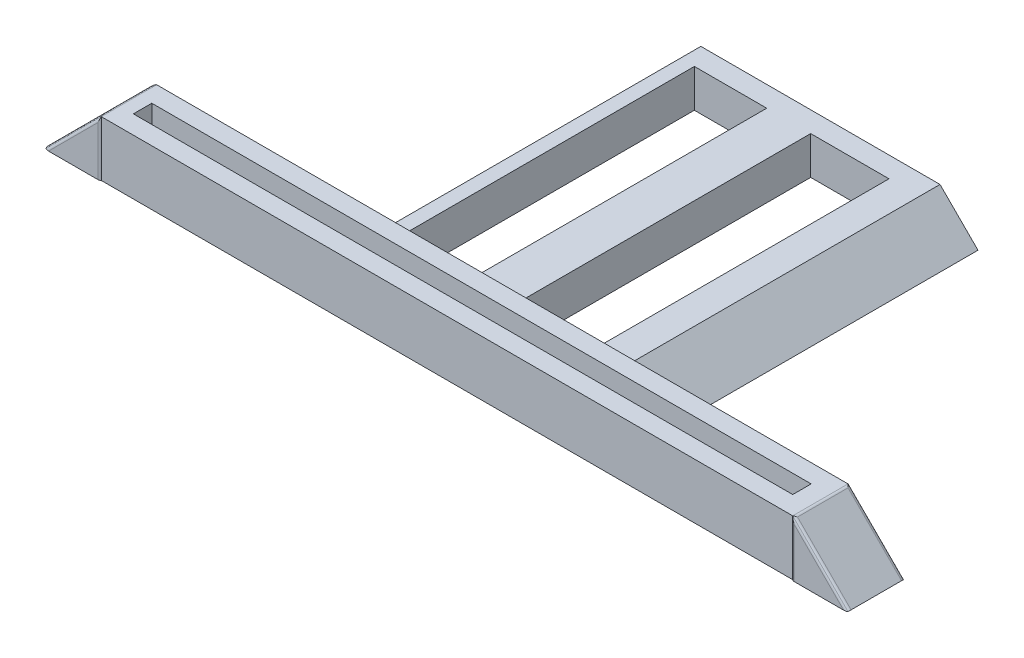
ISO-10303-21;
HEADER;
FILE_DESCRIPTION(('STEP AP214'),'2;1');
FILE_NAME('part.step','',(''),(''),'','','');
FILE_SCHEMA(('AUTOMOTIVE_DESIGN { 1 0 10303 214 1 1 1 1 }'));
ENDSEC;
DATA;
#1=APPLICATION_CONTEXT('core data for automotive mechanical design processes');
#2=APPLICATION_PROTOCOL_DEFINITION('international standard','automotive_design',2000,#1);
#3=PRODUCT_CONTEXT('',#1,'mechanical');
#4=PRODUCT('Part','Part','',(#3));
#5=PRODUCT_RELATED_PRODUCT_CATEGORY('part','',(#4));
#6=PRODUCT_DEFINITION_FORMATION('','',#4);
#7=PRODUCT_DEFINITION_CONTEXT('part definition',#1,'design');
#8=PRODUCT_DEFINITION('design','',#6,#7);
#9=PRODUCT_DEFINITION_SHAPE('','',#8);
#10=(LENGTH_UNIT() NAMED_UNIT(*) SI_UNIT(.MILLI.,.METRE.));
#11=(NAMED_UNIT(*) PLANE_ANGLE_UNIT() SI_UNIT($,.RADIAN.));
#12=(NAMED_UNIT(*) SI_UNIT($,.STERADIAN.) SOLID_ANGLE_UNIT());
#13=UNCERTAINTY_MEASURE_WITH_UNIT(LENGTH_MEASURE(1.E-05),#10,'distance_accuracy_value','');
#14=(GEOMETRIC_REPRESENTATION_CONTEXT(3) GLOBAL_UNCERTAINTY_ASSIGNED_CONTEXT((#13)) GLOBAL_UNIT_ASSIGNED_CONTEXT((#10,
#11,#12)) REPRESENTATION_CONTEXT('',''));
#15=CARTESIAN_POINT('',(0.,0.,0.));
#16=DIRECTION('',(0.,0.,1.));
#17=DIRECTION('',(1.,0.,0.));
#18=AXIS2_PLACEMENT_3D('',#15,#16,#17);
#19=CARTESIAN_POINT('',(-1905.,0.,-152.4));
#20=DIRECTION('',(0.,0.,-1.));
#21=DIRECTION('',(-1.,0.,0.));
#22=AXIS2_PLACEMENT_3D('',#19,#20,#21);
#23=PLANE('',#22);
#24=DIRECTION('',(1.,0.,0.));
#25=VECTOR('',#24,1.);
#26=CARTESIAN_POINT('',(-1905.,0.,-152.4));
#27=LINE('',#26,#25);
#28=CARTESIAN_POINT('',(-1905.,0.,-152.4));
#29=VERTEX_POINT('',#28);
#30=CARTESIAN_POINT('',(-1399.16371087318,0.,-152.4));
#31=VERTEX_POINT('',#30);
#32=EDGE_CURVE('E266',#29,#31,#27,.T.);
#33=ORIENTED_EDGE('',*,*,#32,.F.);
#34=DIRECTION('',(0.,-1.,0.));
#35=VECTOR('',#34,1.);
#36=CARTESIAN_POINT('',(-1905.,152.4,-152.4));
#37=LINE('',#36,#35);
#38=CARTESIAN_POINT('',(-1905.,152.4,-152.4));
#39=VERTEX_POINT('',#38);
#40=EDGE_CURVE('E261',#39,#29,#37,.T.);
#41=ORIENTED_EDGE('',*,*,#40,.F.);
#42=DIRECTION('',(1.,0.,0.));
#43=VECTOR('',#42,1.);
#44=CARTESIAN_POINT('',(-1905.,152.4,-152.4));
#45=LINE('',#44,#43);
#46=CARTESIAN_POINT('',(0.,152.4,-152.4));
#47=VERTEX_POINT('',#46);
#48=EDGE_CURVE('E263',#39,#47,#45,.T.);
#49=ORIENTED_EDGE('',*,*,#48,.T.);
#50=DIRECTION('',(0.,1.,0.));
#51=VECTOR('',#50,1.);
#52=CARTESIAN_POINT('',(0.,152.4,-152.4));
#53=LINE('',#52,#51);
#54=CARTESIAN_POINT('',(0.,0.,-152.4));
#55=VERTEX_POINT('',#54);
#56=EDGE_CURVE('E340',#55,#47,#53,.T.);
#57=ORIENTED_EDGE('',*,*,#56,.F.);
#58=CARTESIAN_POINT('',(-530.916609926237,0.,-152.4));
#59=VERTEX_POINT('',#58);
#60=EDGE_CURVE('E329',#59,#55,#27,.T.);
#61=ORIENTED_EDGE('',*,*,#60,.F.);
#62=DIRECTION('',(0.707106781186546,-0.707106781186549,0.));
#63=VECTOR('',#62,1.);
#64=CARTESIAN_POINT('',(-530.916609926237,0.,-152.4));
#65=LINE('',#64,#63);
#66=CARTESIAN_POINT('',(-635.558878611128,104.642268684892,-152.4));
#67=VERTEX_POINT('',#66);
#68=EDGE_CURVE('E477',#67,#59,#65,.T.);
#69=ORIENTED_EDGE('',*,*,#68,.F.);
#70=DIRECTION('',(1.,0.,0.));
#71=VECTOR('',#70,1.);
#72=CARTESIAN_POINT('',(-635.558878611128,104.642268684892,-152.4));
#73=LINE('',#72,#71);
#74=CARTESIAN_POINT('',(-1294.52144218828,104.642268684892,-152.4));
#75=VERTEX_POINT('',#74);
#76=EDGE_CURVE('E486',#75,#67,#73,.T.);
#77=ORIENTED_EDGE('',*,*,#76,.F.);
#78=DIRECTION('',(0.707106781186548,0.707106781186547,0.));
#79=VECTOR('',#78,1.);
#80=CARTESIAN_POINT('',(-1294.52144218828,104.642268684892,-152.4));
#81=LINE('',#80,#79);
#82=EDGE_CURVE('E472',#31,#75,#81,.T.);
#83=ORIENTED_EDGE('',*,*,#82,.F.);
#84=EDGE_LOOP('',(#33,#41,#49,#57,#61,#69,#77,#83));
#85=FACE_BOUND('',#84,.T.);
#86=ADVANCED_FACE('F35',(#85),#23,.T.);
#87=CARTESIAN_POINT('',(-1905.,0.,0.));
#88=DIRECTION('',(0.,0.,1.));
#89=DIRECTION('',(1.,0.,0.));
#90=AXIS2_PLACEMENT_3D('',#87,#88,#89);
#91=PLANE('',#90);
#92=DIRECTION('',(1.,0.,0.));
#93=VECTOR('',#92,1.);
#94=CARTESIAN_POINT('',(-1905.,152.4,0.));
#95=LINE('',#94,#93);
#96=CARTESIAN_POINT('',(-1905.,152.4,0.));
#97=VERTEX_POINT('',#96);
#98=CARTESIAN_POINT('',(0.,152.4,0.));
#99=VERTEX_POINT('',#98);
#100=EDGE_CURVE('E281',#97,#99,#95,.T.);
#101=ORIENTED_EDGE('',*,*,#100,.F.);
#102=DIRECTION('',(0.,1.,0.));
#103=VECTOR('',#102,1.);
#104=CARTESIAN_POINT('',(-1905.,152.4,0.));
#105=LINE('',#104,#103);
#106=CARTESIAN_POINT('',(-1905.,4.13763673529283E-13,0.));
#107=VERTEX_POINT('',#106);
#108=EDGE_CURVE('E317',#107,#97,#105,.T.);
#109=ORIENTED_EDGE('',*,*,#108,.F.);
#110=DIRECTION('',(1.,0.,0.));
#111=VECTOR('',#110,1.);
#112=CARTESIAN_POINT('',(-1905.,0.,0.));
#113=LINE('',#112,#111);
#114=CARTESIAN_POINT('',(0.,0.,0.));
#115=VERTEX_POINT('',#114);
#116=EDGE_CURVE('E294',#107,#115,#113,.T.);
#117=ORIENTED_EDGE('',*,*,#116,.T.);
#118=DIRECTION('',(0.,-1.,0.));
#119=VECTOR('',#118,1.);
#120=CARTESIAN_POINT('',(0.,152.4,0.));
#121=LINE('',#120,#119);
#122=EDGE_CURVE('E319',#99,#115,#121,.T.);
#123=ORIENTED_EDGE('',*,*,#122,.F.);
#124=EDGE_LOOP('',(#101,#109,#117,#123));
#125=FACE_BOUND('',#124,.T.);
#126=ADVANCED_FACE('F316',(#125),#91,.T.);
#127=CARTESIAN_POINT('',(-1905.,152.4,0.));
#128=DIRECTION('',(0.,1.,0.));
#129=DIRECTION('',(0.,0.,1.));
#130=AXIS2_PLACEMENT_3D('',#127,#128,#129);
#131=PLANE('',#130);
#132=DIRECTION('',(0.,0.,1.));
#133=VECTOR('',#132,1.);
#134=CARTESIAN_POINT('',(-1867.49816376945,152.4,-50.8));
#135=LINE('',#134,#133);
#136=CARTESIAN_POINT('',(-1867.49816376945,152.4,-101.6));
#137=VERTEX_POINT('',#136);
#138=CARTESIAN_POINT('',(-1867.49816376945,152.4,-50.8));
#139=VERTEX_POINT('',#138);
#140=EDGE_CURVE('E502',#137,#139,#135,.T.);
#141=ORIENTED_EDGE('',*,*,#140,.F.);
#142=DIRECTION('',(-1.,0.,0.));
#143=VECTOR('',#142,1.);
#144=CARTESIAN_POINT('',(-1867.49816376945,152.4,-101.6));
#145=LINE('',#144,#143);
#146=CARTESIAN_POINT('',(-50.8,152.4,-101.6));
#147=VERTEX_POINT('',#146);
#148=EDGE_CURVE('E507',#147,#137,#145,.T.);
#149=ORIENTED_EDGE('',*,*,#148,.F.);
#150=DIRECTION('',(0.,0.,-1.));
#151=VECTOR('',#150,1.);
#152=CARTESIAN_POINT('',(-50.8,152.4,-50.8));
#153=LINE('',#152,#151);
#154=CARTESIAN_POINT('',(-50.8,152.4,-50.8));
#155=VERTEX_POINT('',#154);
#156=EDGE_CURVE('E521',#155,#147,#153,.T.);
#157=ORIENTED_EDGE('',*,*,#156,.F.);
#158=DIRECTION('',(1.,0.,0.));
#159=VECTOR('',#158,1.);
#160=CARTESIAN_POINT('',(-1867.49816376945,152.4,-50.8));
#161=LINE('',#160,#159);
#162=EDGE_CURVE('E518',#139,#155,#161,.T.);
#163=ORIENTED_EDGE('',*,*,#162,.F.);
#164=EDGE_LOOP('',(#141,#149,#157,#163));
#165=FACE_BOUND('',#164,.T.);
#166=DIRECTION('',(0.,0.,1.));
#167=VECTOR('',#166,1.);
#168=CARTESIAN_POINT('',(0.,152.4,0.));
#169=LINE('',#168,#167);
#170=EDGE_CURVE('E279',#47,#99,#169,.T.);
#171=ORIENTED_EDGE('',*,*,#170,.F.);
#172=ORIENTED_EDGE('',*,*,#48,.F.);
#173=DIRECTION('',(0.,0.,1.));
#174=VECTOR('',#173,1.);
#175=CARTESIAN_POINT('',(-1905.,152.4,0.));
#176=LINE('',#175,#174);
#177=EDGE_CURVE('E276',#39,#97,#176,.T.);
#178=ORIENTED_EDGE('',*,*,#177,.T.);
#179=ORIENTED_EDGE('',*,*,#100,.T.);
#180=EDGE_LOOP('',(#171,#172,#178,#179));
#181=FACE_BOUND('',#180,.T.);
#182=ADVANCED_FACE('F274',(#165,#181),#131,.T.);
#183=CARTESIAN_POINT('',(-1905.,0.,0.));
#184=DIRECTION('',(0.,-1.,0.));
#185=DIRECTION('',(0.,0.,-1.));
#186=AXIS2_PLACEMENT_3D('',#183,#184,#185);
#187=PLANE('',#186);
#188=DIRECTION('',(0.,0.,-1.));
#189=VECTOR('',#188,1.);
#190=CARTESIAN_POINT('',(-1255.57133941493,0.,0.));
#191=LINE('',#190,#189);
#192=CARTESIAN_POINT('',(-1255.57133941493,0.,-192.573008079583));
#193=VERTEX_POINT('',#192);
#194=CARTESIAN_POINT('',(-1255.57133941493,0.,-984.588068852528));
#195=VERTEX_POINT('',#194);
#196=EDGE_CURVE('E470',#193,#195,#191,.T.);
#197=ORIENTED_EDGE('',*,*,#196,.F.);
#198=DIRECTION('',(-1.,0.,0.));
#199=VECTOR('',#198,1.);
#200=CARTESIAN_POINT('',(-1905.,0.,-192.573008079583));
#201=LINE('',#200,#199);
#202=CARTESIAN_POINT('',(-1056.17579463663,0.,-192.573008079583));
#203=VERTEX_POINT('',#202);
#204=EDGE_CURVE('E463',#203,#193,#201,.T.);
#205=ORIENTED_EDGE('',*,*,#204,.F.);
#206=DIRECTION('',(0.,0.,1.));
#207=VECTOR('',#206,1.);
#208=CARTESIAN_POINT('',(-1056.17579463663,0.,0.));
#209=LINE('',#208,#207);
#210=CARTESIAN_POINT('',(-1056.17579463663,0.,-984.588068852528));
#211=VERTEX_POINT('',#210);
#212=EDGE_CURVE('E465',#211,#203,#209,.T.);
#213=ORIENTED_EDGE('',*,*,#212,.F.);
#214=DIRECTION('',(1.,0.,0.));
#215=VECTOR('',#214,1.);
#216=CARTESIAN_POINT('',(-1905.,0.,-984.588068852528));
#217=LINE('',#216,#215);
#218=EDGE_CURVE('E468',#195,#211,#217,.T.);
#219=ORIENTED_EDGE('',*,*,#218,.F.);
#220=EDGE_LOOP('',(#197,#205,#213,#219));
#221=FACE_BOUND('',#220,.T.);
#222=DIRECTION('',(0.,0.,-1.));
#223=VECTOR('',#222,1.);
#224=CARTESIAN_POINT('',(-935.116105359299,0.,0.));
#225=LINE('',#224,#223);
#226=CARTESIAN_POINT('',(-935.116105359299,0.,-192.573008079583));
#227=VERTEX_POINT('',#226);
#228=CARTESIAN_POINT('',(-935.116105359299,0.,-984.588068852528));
#229=VERTEX_POINT('',#228);
#230=EDGE_CURVE('E461',#227,#229,#225,.T.);
#231=ORIENTED_EDGE('',*,*,#230,.F.);
#232=DIRECTION('',(-1.,0.,0.));
#233=VECTOR('',#232,1.);
#234=CARTESIAN_POINT('',(-1905.,0.,-192.573008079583));
#235=LINE('',#234,#233);
#236=CARTESIAN_POINT('',(-719.340035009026,0.,-192.573008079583));
#237=VERTEX_POINT('',#236);
#238=EDGE_CURVE('E430',#237,#227,#235,.T.);
#239=ORIENTED_EDGE('',*,*,#238,.F.);
#240=DIRECTION('',(0.,0.,1.));
#241=VECTOR('',#240,1.);
#242=CARTESIAN_POINT('',(-719.340035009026,0.,0.));
#243=LINE('',#242,#241);
#244=CARTESIAN_POINT('',(-719.340035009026,0.,-984.588068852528));
#245=VERTEX_POINT('',#244);
#246=EDGE_CURVE('E456',#245,#237,#243,.T.);
#247=ORIENTED_EDGE('',*,*,#246,.F.);
#248=DIRECTION('',(1.,0.,0.));
#249=VECTOR('',#248,1.);
#250=CARTESIAN_POINT('',(-1905.,0.,-984.588068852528));
#251=LINE('',#250,#249);
#252=EDGE_CURVE('E459',#229,#245,#251,.T.);
#253=ORIENTED_EDGE('',*,*,#252,.F.);
#254=EDGE_LOOP('',(#231,#239,#247,#253));
#255=FACE_BOUND('',#254,.T.);
#256=ORIENTED_EDGE('',*,*,#116,.F.);
#257=CARTESIAN_POINT('',(-1911.65945943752,0.,-7.46));
#258=DIRECTION('',(0.,-1.,0.));
#259=DIRECTION('',(0.,0.,-1.));
#260=AXIS2_PLACEMENT_3D('',#257,#258,#259);
#261=CIRCLE('',#260,10.);
#262=CARTESIAN_POINT('',(-1911.65945943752,0.,2.54));
#263=VERTEX_POINT('',#262);
#264=EDGE_CURVE('E11',#107,#263,#261,.T.);
#265=ORIENTED_EDGE('',*,*,#264,.T.);
#266=DIRECTION('',(1.,0.,0.));
#267=VECTOR('',#266,1.);
#268=CARTESIAN_POINT('',(-1905.,4.13763673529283E-13,2.54));
#269=LINE('',#268,#267);
#270=CARTESIAN_POINT('',(-2047.98210214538,0.,2.54));
#271=VERTEX_POINT('',#270);
#272=EDGE_CURVE('E399',#271,#263,#269,.T.);
#273=ORIENTED_EDGE('',*,*,#272,.F.);
#274=CARTESIAN_POINT('',(-2047.98210214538,0.,-7.46));
#275=DIRECTION('',(0.,-1.,0.));
#276=DIRECTION('',(-1.,0.,0.));
#277=AXIS2_PLACEMENT_3D('',#274,#275,#276);
#278=ELLIPSE('',#277,14.1421356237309,10.);
#279=CARTESIAN_POINT('',(-2057.4,4.44089209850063E-13,0.));
#280=VERTEX_POINT('',#279);
#281=EDGE_CURVE('E379',#271,#280,#278,.T.);
#282=ORIENTED_EDGE('',*,*,#281,.T.);
#283=DIRECTION('',(0.,0.,1.));
#284=VECTOR('',#283,1.);
#285=CARTESIAN_POINT('',(-2057.4,0.,-152.4));
#286=LINE('',#285,#284);
#287=CARTESIAN_POINT('',(-2057.4,4.44089209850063E-13,-152.4));
#288=VERTEX_POINT('',#287);
#289=EDGE_CURVE('E537',#288,#280,#286,.T.);
#290=ORIENTED_EDGE('',*,*,#289,.F.);
#291=CARTESIAN_POINT('',(-2047.98210214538,0.,-144.94));
#292=DIRECTION('',(0.,-1.,0.));
#293=DIRECTION('',(1.,0.,0.));
#294=AXIS2_PLACEMENT_3D('',#291,#292,#293);
#295=ELLIPSE('',#294,14.1421356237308,10.);
#296=CARTESIAN_POINT('',(-2047.98210214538,0.,-154.94));
#297=VERTEX_POINT('',#296);
#298=EDGE_CURVE('E290',#288,#297,#295,.T.);
#299=ORIENTED_EDGE('',*,*,#298,.T.);
#300=DIRECTION('',(-1.,0.,0.));
#301=VECTOR('',#300,1.);
#302=CARTESIAN_POINT('',(-1905.,3.37971833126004E-13,-154.94));
#303=LINE('',#302,#301);
#304=CARTESIAN_POINT('',(-1911.65945943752,0.,-154.94));
#305=VERTEX_POINT('',#304);
#306=EDGE_CURVE('E269',#305,#297,#303,.T.);
#307=ORIENTED_EDGE('',*,*,#306,.F.);
#308=CARTESIAN_POINT('',(-1911.65945943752,0.,-144.94));
#309=DIRECTION('',(0.,-1.,0.));
#310=DIRECTION('',(0.,0.,-1.));
#311=AXIS2_PLACEMENT_3D('',#308,#309,#310);
#312=CIRCLE('',#311,10.);
#313=EDGE_CURVE('E301',#305,#29,#312,.T.);
#314=ORIENTED_EDGE('',*,*,#313,.T.);
#315=ORIENTED_EDGE('',*,*,#32,.T.);
#316=DIRECTION('',(0.,0.,1.));
#317=VECTOR('',#316,1.);
#318=CARTESIAN_POINT('',(-1399.16371087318,0.,-1041.4));
#319=LINE('',#318,#317);
#320=CARTESIAN_POINT('',(-1399.16371087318,0.,-1041.4));
#321=VERTEX_POINT('',#320);
#322=EDGE_CURVE('E499',#321,#31,#319,.T.);
#323=ORIENTED_EDGE('',*,*,#322,.F.);
#324=DIRECTION('',(-1.,0.,0.));
#325=VECTOR('',#324,1.);
#326=CARTESIAN_POINT('',(-1399.16371087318,0.,-1041.4));
#327=LINE('',#326,#325);
#328=CARTESIAN_POINT('',(-530.916609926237,0.,-1041.4));
#329=VERTEX_POINT('',#328);
#330=EDGE_CURVE('E473',#329,#321,#327,.T.);
#331=ORIENTED_EDGE('',*,*,#330,.F.);
#332=DIRECTION('',(0.,0.,1.));
#333=VECTOR('',#332,1.);
#334=CARTESIAN_POINT('',(-530.916609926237,0.,-1041.4));
#335=LINE('',#334,#333);
#336=EDGE_CURVE('E483',#329,#59,#335,.T.);
#337=ORIENTED_EDGE('',*,*,#336,.T.);
#338=ORIENTED_EDGE('',*,*,#60,.T.);
#339=CARTESIAN_POINT('',(6.65945943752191,0.,-144.94));
#340=DIRECTION('',(0.,-1.,0.));
#341=DIRECTION('',(0.,0.,-1.));
#342=AXIS2_PLACEMENT_3D('',#339,#340,#341);
#343=CIRCLE('',#342,10.);
#344=CARTESIAN_POINT('',(6.65945943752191,0.,-154.94));
#345=VERTEX_POINT('',#344);
#346=EDGE_CURVE('E375',#55,#345,#343,.T.);
#347=ORIENTED_EDGE('',*,*,#346,.T.);
#348=DIRECTION('',(-1.,0.,0.));
#349=VECTOR('',#348,1.);
#350=CARTESIAN_POINT('',(0.,0.,-154.94));
#351=LINE('',#350,#349);
#352=CARTESIAN_POINT('',(142.982102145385,0.,-154.94));
#353=VERTEX_POINT('',#352);
#354=EDGE_CURVE('E407',#353,#345,#351,.T.);
#355=ORIENTED_EDGE('',*,*,#354,.F.);
#356=CARTESIAN_POINT('',(142.982102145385,0.,-144.94));
#357=DIRECTION('',(0.,-1.,0.));
#358=DIRECTION('',(1.,0.,0.));
#359=AXIS2_PLACEMENT_3D('',#356,#357,#358);
#360=ELLIPSE('',#359,14.1421356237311,10.);
#361=CARTESIAN_POINT('',(152.400000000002,0.,-152.4));
#362=VERTEX_POINT('',#361);
#363=EDGE_CURVE('E335',#353,#362,#360,.T.);
#364=ORIENTED_EDGE('',*,*,#363,.T.);
#365=DIRECTION('',(0.,0.,1.));
#366=VECTOR('',#365,1.);
#367=CARTESIAN_POINT('',(152.400000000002,0.,-152.4));
#368=LINE('',#367,#366);
#369=CARTESIAN_POINT('',(152.400000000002,0.,0.));
#370=VERTEX_POINT('',#369);
#371=EDGE_CURVE('E528',#362,#370,#368,.T.);
#372=ORIENTED_EDGE('',*,*,#371,.T.);
#373=CARTESIAN_POINT('',(142.982102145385,0.,-7.46));
#374=DIRECTION('',(0.,-1.,0.));
#375=DIRECTION('',(-1.,0.,0.));
#376=AXIS2_PLACEMENT_3D('',#373,#374,#375);
#377=ELLIPSE('',#376,14.1421356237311,10.);
#378=CARTESIAN_POINT('',(142.982102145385,0.,2.54));
#379=VERTEX_POINT('',#378);
#380=EDGE_CURVE('E348',#370,#379,#377,.T.);
#381=ORIENTED_EDGE('',*,*,#380,.T.);
#382=DIRECTION('',(1.,0.,0.));
#383=VECTOR('',#382,1.);
#384=CARTESIAN_POINT('',(0.,0.,2.54));
#385=LINE('',#384,#383);
#386=CARTESIAN_POINT('',(6.65945943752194,0.,2.54));
#387=VERTEX_POINT('',#386);
#388=EDGE_CURVE('E341',#387,#379,#385,.T.);
#389=ORIENTED_EDGE('',*,*,#388,.F.);
#390=CARTESIAN_POINT('',(6.65945943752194,0.,-7.46));
#391=DIRECTION('',(0.,-1.,0.));
#392=DIRECTION('',(0.,0.,-1.));
#393=AXIS2_PLACEMENT_3D('',#390,#391,#392);
#394=CIRCLE('',#393,10.);
#395=EDGE_CURVE('E358',#387,#115,#394,.T.);
#396=ORIENTED_EDGE('',*,*,#395,.T.);
#397=EDGE_LOOP('',(#256,#265,#273,#282,#290,#299,#307,#314,#315,#323,#331,#337,#338,#347,#355,
#364,#372,#381,#389,#396));
#398=FACE_BOUND('',#397,.T.);
#399=ADVANCED_FACE('F396',(#221,#255,#398),#187,.T.);
#400=CARTESIAN_POINT('',(-1867.49816376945,76.2,-50.8));
#401=DIRECTION('',(-1.,0.,0.));
#402=DIRECTION('',(0.,0.,1.));
#403=AXIS2_PLACEMENT_3D('',#400,#401,#402);
#404=PLANE('',#403);
#405=ORIENTED_EDGE('',*,*,#140,.T.);
#406=DIRECTION('',(0.,1.,0.));
#407=VECTOR('',#406,1.);
#408=CARTESIAN_POINT('',(-1867.49816376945,76.2,-50.8));
#409=LINE('',#408,#407);
#410=CARTESIAN_POINT('',(-1867.49816376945,76.2,-50.8));
#411=VERTEX_POINT('',#410);
#412=EDGE_CURVE('E516',#411,#139,#409,.T.);
#413=ORIENTED_EDGE('',*,*,#412,.F.);
#414=DIRECTION('',(0.,0.,1.));
#415=VECTOR('',#414,1.);
#416=CARTESIAN_POINT('',(-1867.49816376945,76.2,-50.8));
#417=LINE('',#416,#415);
#418=CARTESIAN_POINT('',(-1867.49816376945,76.2,-101.6));
#419=VERTEX_POINT('',#418);
#420=EDGE_CURVE('E503',#419,#411,#417,.T.);
#421=ORIENTED_EDGE('',*,*,#420,.F.);
#422=DIRECTION('',(0.,1.,0.));
#423=VECTOR('',#422,1.);
#424=CARTESIAN_POINT('',(-1867.49816376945,76.2,-101.6));
#425=LINE('',#424,#423);
#426=EDGE_CURVE('E526',#419,#137,#425,.T.);
#427=ORIENTED_EDGE('',*,*,#426,.T.);
#428=EDGE_LOOP('',(#405,#413,#421,#427));
#429=FACE_BOUND('',#428,.T.);
#430=ADVANCED_FACE('F592',(#429),#404,.F.);
#431=CARTESIAN_POINT('',(-1867.49816376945,76.2,-101.6));
#432=DIRECTION('',(0.,0.,-1.));
#433=DIRECTION('',(-1.,0.,0.));
#434=AXIS2_PLACEMENT_3D('',#431,#432,#433);
#435=PLANE('',#434);
#436=ORIENTED_EDGE('',*,*,#148,.T.);
#437=ORIENTED_EDGE('',*,*,#426,.F.);
#438=DIRECTION('',(-1.,0.,0.));
#439=VECTOR('',#438,1.);
#440=CARTESIAN_POINT('',(-1867.49816376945,76.2,-101.6));
#441=LINE('',#440,#439);
#442=CARTESIAN_POINT('',(-50.8,76.2,-101.6));
#443=VERTEX_POINT('',#442);
#444=EDGE_CURVE('E513',#443,#419,#441,.T.);
#445=ORIENTED_EDGE('',*,*,#444,.F.);
#446=DIRECTION('',(0.,1.,0.));
#447=VECTOR('',#446,1.);
#448=CARTESIAN_POINT('',(-50.8,76.2,-101.6));
#449=LINE('',#448,#447);
#450=EDGE_CURVE('E529',#443,#147,#449,.T.);
#451=ORIENTED_EDGE('',*,*,#450,.T.);
#452=EDGE_LOOP('',(#436,#437,#445,#451));
#453=FACE_BOUND('',#452,.T.);
#454=ADVANCED_FACE('F721',(#453),#435,.F.);
#455=CARTESIAN_POINT('',(-50.8,76.2,-50.8));
#456=DIRECTION('',(1.,0.,0.));
#457=DIRECTION('',(0.,0.,-1.));
#458=AXIS2_PLACEMENT_3D('',#455,#456,#457);
#459=PLANE('',#458);
#460=ORIENTED_EDGE('',*,*,#156,.T.);
#461=ORIENTED_EDGE('',*,*,#450,.F.);
#462=DIRECTION('',(0.,0.,-1.));
#463=VECTOR('',#462,1.);
#464=CARTESIAN_POINT('',(-50.8,76.2,-50.8));
#465=LINE('',#464,#463);
#466=CARTESIAN_POINT('',(-50.8,76.2,-50.8));
#467=VERTEX_POINT('',#466);
#468=EDGE_CURVE('E510',#467,#443,#465,.T.);
#469=ORIENTED_EDGE('',*,*,#468,.F.);
#470=DIRECTION('',(0.,1.,0.));
#471=VECTOR('',#470,1.);
#472=CARTESIAN_POINT('',(-50.8,76.2,-50.8));
#473=LINE('',#472,#471);
#474=EDGE_CURVE('E531',#467,#155,#473,.T.);
#475=ORIENTED_EDGE('',*,*,#474,.T.);
#476=EDGE_LOOP('',(#460,#461,#469,#475));
#477=FACE_BOUND('',#476,.T.);
#478=ADVANCED_FACE('F724',(#477),#459,.F.);
#479=CARTESIAN_POINT('',(-1867.49816376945,76.2,-50.8));
#480=DIRECTION('',(0.,0.,1.));
#481=DIRECTION('',(1.,0.,0.));
#482=AXIS2_PLACEMENT_3D('',#479,#480,#481);
#483=PLANE('',#482);
#484=ORIENTED_EDGE('',*,*,#162,.T.);
#485=ORIENTED_EDGE('',*,*,#474,.F.);
#486=DIRECTION('',(1.,0.,0.));
#487=VECTOR('',#486,1.);
#488=CARTESIAN_POINT('',(-1867.49816376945,76.2,-50.8));
#489=LINE('',#488,#487);
#490=EDGE_CURVE('E506',#411,#467,#489,.T.);
#491=ORIENTED_EDGE('',*,*,#490,.F.);
#492=ORIENTED_EDGE('',*,*,#412,.T.);
#493=EDGE_LOOP('',(#484,#485,#491,#492));
#494=FACE_BOUND('',#493,.T.);
#495=ADVANCED_FACE('F719',(#494),#483,.F.);
#496=CARTESIAN_POINT('',(0.,76.2,0.));
#497=DIRECTION('',(0.,-1.,0.));
#498=DIRECTION('',(0.,0.,-1.));
#499=AXIS2_PLACEMENT_3D('',#496,#497,#498);
#500=PLANE('',#499);
#501=ORIENTED_EDGE('',*,*,#420,.T.);
#502=ORIENTED_EDGE('',*,*,#490,.T.);
#503=ORIENTED_EDGE('',*,*,#468,.T.);
#504=ORIENTED_EDGE('',*,*,#444,.T.);
#505=EDGE_LOOP('',(#501,#502,#503,#504));
#506=FACE_BOUND('',#505,.T.);
#507=ADVANCED_FACE('F713',(#506),#500,.F.);
#508=CARTESIAN_POINT('',(-1294.52144218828,104.642268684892,-1041.4));
#509=DIRECTION('',(0.707106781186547,-0.707106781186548,0.));
#510=DIRECTION('',(0.707106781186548,0.707106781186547,0.));
#511=AXIS2_PLACEMENT_3D('',#508,#509,#510);
#512=PLANE('',#511);
#513=ORIENTED_EDGE('',*,*,#82,.T.);
#514=DIRECTION('',(0.,0.,1.));
#515=VECTOR('',#514,1.);
#516=CARTESIAN_POINT('',(-1294.52144218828,104.642268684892,-1041.4));
#517=LINE('',#516,#515);
#518=CARTESIAN_POINT('',(-1294.52144218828,104.642268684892,-1041.4));
#519=VERTEX_POINT('',#518);
#520=EDGE_CURVE('E496',#519,#75,#517,.T.);
#521=ORIENTED_EDGE('',*,*,#520,.F.);
#522=DIRECTION('',(0.707106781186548,0.707106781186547,0.));
#523=VECTOR('',#522,1.);
#524=CARTESIAN_POINT('',(-1294.52144218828,104.642268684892,-1041.4));
#525=LINE('',#524,#523);
#526=EDGE_CURVE('E476',#321,#519,#525,.T.);
#527=ORIENTED_EDGE('',*,*,#526,.F.);
#528=ORIENTED_EDGE('',*,*,#322,.T.);
#529=EDGE_LOOP('',(#513,#521,#527,#528));
#530=FACE_BOUND('',#529,.T.);
#531=ADVANCED_FACE('F565',(#530),#512,.F.);
#532=CARTESIAN_POINT('',(-635.558878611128,104.642268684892,-1041.4));
#533=DIRECTION('',(0.,-1.,0.));
#534=DIRECTION('',(0.,0.,-1.));
#535=AXIS2_PLACEMENT_3D('',#532,#533,#534);
#536=PLANE('',#535);
#537=DIRECTION('',(1.,0.,0.));
#538=VECTOR('',#537,1.);
#539=CARTESIAN_POINT('',(-1255.57133941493,104.642268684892,-192.573008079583));
#540=LINE('',#539,#538);
#541=CARTESIAN_POINT('',(-1255.57133941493,104.642268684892,-192.573008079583));
#542=VERTEX_POINT('',#541);
#543=CARTESIAN_POINT('',(-1056.17579463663,104.642268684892,-192.573008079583));
#544=VERTEX_POINT('',#543);
#545=EDGE_CURVE('E417',#542,#544,#540,.T.);
#546=ORIENTED_EDGE('',*,*,#545,.F.);
#547=DIRECTION('',(0.,0.,1.));
#548=VECTOR('',#547,1.);
#549=CARTESIAN_POINT('',(-1255.57133941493,104.642268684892,-192.573008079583));
#550=LINE('',#549,#548);
#551=CARTESIAN_POINT('',(-1255.57133941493,104.642268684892,-984.588068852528));
#552=VERTEX_POINT('',#551);
#553=EDGE_CURVE('E415',#552,#542,#550,.T.);
#554=ORIENTED_EDGE('',*,*,#553,.F.);
#555=DIRECTION('',(-1.,0.,0.));
#556=VECTOR('',#555,1.);
#557=CARTESIAN_POINT('',(-1255.57133941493,104.642268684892,-984.588068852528));
#558=LINE('',#557,#556);
#559=CARTESIAN_POINT('',(-1056.17579463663,104.642268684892,-984.588068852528));
#560=VERTEX_POINT('',#559);
#561=EDGE_CURVE('E424',#560,#552,#558,.T.);
#562=ORIENTED_EDGE('',*,*,#561,.F.);
#563=DIRECTION('',(0.,0.,-1.));
#564=VECTOR('',#563,1.);
#565=CARTESIAN_POINT('',(-1056.17579463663,104.642268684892,-192.573008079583));
#566=LINE('',#565,#564);
#567=EDGE_CURVE('E421',#544,#560,#566,.T.);
#568=ORIENTED_EDGE('',*,*,#567,.F.);
#569=EDGE_LOOP('',(#546,#554,#562,#568));
#570=FACE_BOUND('',#569,.T.);
#571=DIRECTION('',(1.,0.,0.));
#572=VECTOR('',#571,1.);
#573=CARTESIAN_POINT('',(-935.116105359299,104.642268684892,-192.573008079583));
#574=LINE('',#573,#572);
#575=CARTESIAN_POINT('',(-935.116105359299,104.642268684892,-192.573008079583));
#576=VERTEX_POINT('',#575);
#577=CARTESIAN_POINT('',(-719.340035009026,104.642268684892,-192.573008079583));
#578=VERTEX_POINT('',#577);
#579=EDGE_CURVE('E438',#576,#578,#574,.T.);
#580=ORIENTED_EDGE('',*,*,#579,.F.);
#581=DIRECTION('',(0.,0.,1.));
#582=VECTOR('',#581,1.);
#583=CARTESIAN_POINT('',(-935.116105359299,104.642268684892,-192.573008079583));
#584=LINE('',#583,#582);
#585=CARTESIAN_POINT('',(-935.116105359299,104.642268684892,-984.588068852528));
#586=VERTEX_POINT('',#585);
#587=EDGE_CURVE('E414',#586,#576,#584,.T.);
#588=ORIENTED_EDGE('',*,*,#587,.F.);
#589=DIRECTION('',(-1.,0.,0.));
#590=VECTOR('',#589,1.);
#591=CARTESIAN_POINT('',(-935.116105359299,104.642268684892,-984.588068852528));
#592=LINE('',#591,#590);
#593=CARTESIAN_POINT('',(-719.340035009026,104.642268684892,-984.588068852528));
#594=VERTEX_POINT('',#593);
#595=EDGE_CURVE('E444',#594,#586,#592,.T.);
#596=ORIENTED_EDGE('',*,*,#595,.F.);
#597=DIRECTION('',(0.,0.,-1.));
#598=VECTOR('',#597,1.);
#599=CARTESIAN_POINT('',(-719.340035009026,104.642268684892,-192.573008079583));
#600=LINE('',#599,#598);
#601=EDGE_CURVE('E441',#578,#594,#600,.T.);
#602=ORIENTED_EDGE('',*,*,#601,.F.);
#603=EDGE_LOOP('',(#580,#588,#596,#602));
#604=FACE_BOUND('',#603,.T.);
#605=ORIENTED_EDGE('',*,*,#76,.T.);
#606=DIRECTION('',(0.,0.,1.));
#607=VECTOR('',#606,1.);
#608=CARTESIAN_POINT('',(-635.558878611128,104.642268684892,-1041.4));
#609=LINE('',#608,#607);
#610=CARTESIAN_POINT('',(-635.558878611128,104.642268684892,-1041.4));
#611=VERTEX_POINT('',#610);
#612=EDGE_CURVE('E493',#611,#67,#609,.T.);
#613=ORIENTED_EDGE('',*,*,#612,.F.);
#614=DIRECTION('',(1.,0.,0.));
#615=VECTOR('',#614,1.);
#616=CARTESIAN_POINT('',(-635.558878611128,104.642268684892,-1041.4));
#617=LINE('',#616,#615);
#618=EDGE_CURVE('E479',#519,#611,#617,.T.);
#619=ORIENTED_EDGE('',*,*,#618,.F.);
#620=ORIENTED_EDGE('',*,*,#520,.T.);
#621=EDGE_LOOP('',(#605,#613,#619,#620));
#622=FACE_BOUND('',#621,.T.);
#623=ADVANCED_FACE('F561',(#570,#604,#622),#536,.F.);
#624=CARTESIAN_POINT('',(-530.916609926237,0.,-1041.4));
#625=DIRECTION('',(-0.707106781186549,-0.707106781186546,0.));
#626=DIRECTION('',(0.707106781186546,-0.707106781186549,0.));
#627=AXIS2_PLACEMENT_3D('',#624,#625,#626);
#628=PLANE('',#627);
#629=ORIENTED_EDGE('',*,*,#68,.T.);
#630=ORIENTED_EDGE('',*,*,#336,.F.);
#631=DIRECTION('',(0.707106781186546,-0.707106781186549,0.));
#632=VECTOR('',#631,1.);
#633=CARTESIAN_POINT('',(-530.916609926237,0.,-1041.4));
#634=LINE('',#633,#632);
#635=EDGE_CURVE('E481',#611,#329,#634,.T.);
#636=ORIENTED_EDGE('',*,*,#635,.F.);
#637=ORIENTED_EDGE('',*,*,#612,.T.);
#638=EDGE_LOOP('',(#629,#630,#636,#637));
#639=FACE_BOUND('',#638,.T.);
#640=ADVANCED_FACE('F558',(#639),#628,.F.);
#641=CARTESIAN_POINT('',(0.,0.,-1041.4));
#642=DIRECTION('',(0.,0.,1.));
#643=DIRECTION('',(1.,0.,0.));
#644=AXIS2_PLACEMENT_3D('',#641,#642,#643);
#645=PLANE('',#644);
#646=ORIENTED_EDGE('',*,*,#330,.T.);
#647=ORIENTED_EDGE('',*,*,#526,.T.);
#648=ORIENTED_EDGE('',*,*,#618,.T.);
#649=ORIENTED_EDGE('',*,*,#635,.T.);
#650=EDGE_LOOP('',(#646,#647,#648,#649));
#651=FACE_BOUND('',#650,.T.);
#652=ADVANCED_FACE('F567',(#651),#645,.F.);
#653=CARTESIAN_POINT('',(-935.116105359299,-784.357731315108,-192.573008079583));
#654=DIRECTION('',(-1.,0.,0.));
#655=DIRECTION('',(0.,0.,1.));
#656=AXIS2_PLACEMENT_3D('',#653,#654,#655);
#657=PLANE('',#656);
#658=ORIENTED_EDGE('',*,*,#230,.T.);
#659=DIRECTION('',(0.,1.,0.));
#660=VECTOR('',#659,1.);
#661=CARTESIAN_POINT('',(-935.116105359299,-784.357731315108,-984.588068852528));
#662=LINE('',#661,#660);
#663=EDGE_CURVE('E418',#229,#586,#662,.T.);
#664=ORIENTED_EDGE('',*,*,#663,.T.);
#665=ORIENTED_EDGE('',*,*,#587,.T.);
#666=DIRECTION('',(0.,1.,0.));
#667=VECTOR('',#666,1.);
#668=CARTESIAN_POINT('',(-935.116105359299,-784.357731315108,-192.573008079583));
#669=LINE('',#668,#667);
#670=EDGE_CURVE('E447',#227,#576,#669,.T.);
#671=ORIENTED_EDGE('',*,*,#670,.F.);
#672=EDGE_LOOP('',(#658,#664,#665,#671));
#673=FACE_BOUND('',#672,.T.);
#674=ADVANCED_FACE('F569',(#673),#657,.F.);
#675=CARTESIAN_POINT('',(-935.116105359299,-784.357731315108,-984.588068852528));
#676=DIRECTION('',(0.,0.,-1.));
#677=DIRECTION('',(-1.,0.,0.));
#678=AXIS2_PLACEMENT_3D('',#675,#676,#677);
#679=PLANE('',#678);
#680=ORIENTED_EDGE('',*,*,#252,.T.);
#681=DIRECTION('',(0.,1.,0.));
#682=VECTOR('',#681,1.);
#683=CARTESIAN_POINT('',(-719.340035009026,-784.357731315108,-984.588068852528));
#684=LINE('',#683,#682);
#685=EDGE_CURVE('E449',#245,#594,#684,.T.);
#686=ORIENTED_EDGE('',*,*,#685,.T.);
#687=ORIENTED_EDGE('',*,*,#595,.T.);
#688=ORIENTED_EDGE('',*,*,#663,.F.);
#689=EDGE_LOOP('',(#680,#686,#687,#688));
#690=FACE_BOUND('',#689,.T.);
#691=ADVANCED_FACE('F576',(#690),#679,.F.);
#692=CARTESIAN_POINT('',(-719.340035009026,-784.357731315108,-192.573008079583));
#693=DIRECTION('',(1.,0.,0.));
#694=DIRECTION('',(0.,0.,-1.));
#695=AXIS2_PLACEMENT_3D('',#692,#693,#694);
#696=PLANE('',#695);
#697=ORIENTED_EDGE('',*,*,#246,.T.);
#698=DIRECTION('',(0.,1.,0.));
#699=VECTOR('',#698,1.);
#700=CARTESIAN_POINT('',(-719.340035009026,-784.357731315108,-192.573008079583));
#701=LINE('',#700,#699);
#702=EDGE_CURVE('E451',#237,#578,#701,.T.);
#703=ORIENTED_EDGE('',*,*,#702,.T.);
#704=ORIENTED_EDGE('',*,*,#601,.T.);
#705=ORIENTED_EDGE('',*,*,#685,.F.);
#706=EDGE_LOOP('',(#697,#703,#704,#705));
#707=FACE_BOUND('',#706,.T.);
#708=ADVANCED_FACE('F686',(#707),#696,.F.);
#709=CARTESIAN_POINT('',(-935.116105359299,-784.357731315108,-192.573008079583));
#710=DIRECTION('',(0.,0.,1.));
#711=DIRECTION('',(1.,0.,0.));
#712=AXIS2_PLACEMENT_3D('',#709,#710,#711);
#713=PLANE('',#712);
#714=ORIENTED_EDGE('',*,*,#238,.T.);
#715=ORIENTED_EDGE('',*,*,#670,.T.);
#716=ORIENTED_EDGE('',*,*,#579,.T.);
#717=ORIENTED_EDGE('',*,*,#702,.F.);
#718=EDGE_LOOP('',(#714,#715,#716,#717));
#719=FACE_BOUND('',#718,.T.);
#720=ADVANCED_FACE('F682',(#719),#713,.F.);
#721=CARTESIAN_POINT('',(-1255.57133941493,-784.357731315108,-192.573008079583));
#722=DIRECTION('',(-1.,0.,0.));
#723=DIRECTION('',(0.,0.,1.));
#724=AXIS2_PLACEMENT_3D('',#721,#722,#723);
#725=PLANE('',#724);
#726=ORIENTED_EDGE('',*,*,#196,.T.);
#727=DIRECTION('',(0.,1.,0.));
#728=VECTOR('',#727,1.);
#729=CARTESIAN_POINT('',(-1255.57133941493,-784.357731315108,-984.588068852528));
#730=LINE('',#729,#728);
#731=EDGE_CURVE('E428',#195,#552,#730,.T.);
#732=ORIENTED_EDGE('',*,*,#731,.T.);
#733=ORIENTED_EDGE('',*,*,#553,.T.);
#734=DIRECTION('',(0.,1.,0.));
#735=VECTOR('',#734,1.);
#736=CARTESIAN_POINT('',(-1255.57133941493,-784.357731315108,-192.573008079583));
#737=LINE('',#736,#735);
#738=EDGE_CURVE('E427',#193,#542,#737,.T.);
#739=ORIENTED_EDGE('',*,*,#738,.F.);
#740=EDGE_LOOP('',(#726,#732,#733,#739));
#741=FACE_BOUND('',#740,.T.);
#742=ADVANCED_FACE('F672',(#741),#725,.F.);
#743=CARTESIAN_POINT('',(-1255.57133941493,-784.357731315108,-984.588068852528));
#744=DIRECTION('',(0.,0.,-1.));
#745=DIRECTION('',(-1.,0.,0.));
#746=AXIS2_PLACEMENT_3D('',#743,#744,#745);
#747=PLANE('',#746);
#748=ORIENTED_EDGE('',*,*,#218,.T.);
#749=DIRECTION('',(0.,1.,0.));
#750=VECTOR('',#749,1.);
#751=CARTESIAN_POINT('',(-1056.17579463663,-784.357731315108,-984.588068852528));
#752=LINE('',#751,#750);
#753=EDGE_CURVE('E431',#211,#560,#752,.T.);
#754=ORIENTED_EDGE('',*,*,#753,.T.);
#755=ORIENTED_EDGE('',*,*,#561,.T.);
#756=ORIENTED_EDGE('',*,*,#731,.F.);
#757=EDGE_LOOP('',(#748,#754,#755,#756));
#758=FACE_BOUND('',#757,.T.);
#759=ADVANCED_FACE('F668',(#758),#747,.F.);
#760=CARTESIAN_POINT('',(-1056.17579463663,-784.357731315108,-192.573008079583));
#761=DIRECTION('',(1.,0.,0.));
#762=DIRECTION('',(0.,0.,-1.));
#763=AXIS2_PLACEMENT_3D('',#760,#761,#762);
#764=PLANE('',#763);
#765=ORIENTED_EDGE('',*,*,#212,.T.);
#766=DIRECTION('',(0.,1.,0.));
#767=VECTOR('',#766,1.);
#768=CARTESIAN_POINT('',(-1056.17579463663,-784.357731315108,-192.573008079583));
#769=LINE('',#768,#767);
#770=EDGE_CURVE('E433',#203,#544,#769,.T.);
#771=ORIENTED_EDGE('',*,*,#770,.T.);
#772=ORIENTED_EDGE('',*,*,#567,.T.);
#773=ORIENTED_EDGE('',*,*,#753,.F.);
#774=EDGE_LOOP('',(#765,#771,#772,#773));
#775=FACE_BOUND('',#774,.T.);
#776=ADVANCED_FACE('F671',(#775),#764,.F.);
#777=CARTESIAN_POINT('',(-1255.57133941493,-784.357731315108,-192.573008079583));
#778=DIRECTION('',(0.,0.,1.));
#779=DIRECTION('',(1.,0.,0.));
#780=AXIS2_PLACEMENT_3D('',#777,#778,#779);
#781=PLANE('',#780);
#782=ORIENTED_EDGE('',*,*,#204,.T.);
#783=ORIENTED_EDGE('',*,*,#738,.T.);
#784=ORIENTED_EDGE('',*,*,#545,.T.);
#785=ORIENTED_EDGE('',*,*,#770,.F.);
#786=EDGE_LOOP('',(#782,#783,#784,#785));
#787=FACE_BOUND('',#786,.T.);
#788=ADVANCED_FACE('F666',(#787),#781,.F.);
#789=CARTESIAN_POINT('',(154.196051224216,1.79605122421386,0.));
#790=DIRECTION('',(-0.707106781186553,0.707106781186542,0.));
#791=DIRECTION('',(-0.707106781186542,-0.707106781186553,0.));
#792=AXIS2_PLACEMENT_3D('',#789,#790,#791);
#793=PLANE('',#792);
#794=DIRECTION('',(0.,0.,-1.));
#795=VECTOR('',#794,1.);
#796=CARTESIAN_POINT('',(154.196051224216,1.79605122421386,0.));
#797=LINE('',#796,#795);
#798=CARTESIAN_POINT('',(154.196051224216,1.79605122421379,-6.65945943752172));
#799=VERTEX_POINT('',#798);
#800=CARTESIAN_POINT('',(154.196051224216,1.79605122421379,-145.740540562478));
#801=VERTEX_POINT('',#800);
#802=EDGE_CURVE('E410',#799,#801,#797,.T.);
#803=ORIENTED_EDGE('',*,*,#802,.F.);
#804=CARTESIAN_POINT('',(147.124983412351,-5.27501658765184,-6.65945943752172));
#805=DIRECTION('',(-0.707106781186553,0.707106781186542,0.));
#806=DIRECTION('',(-0.707106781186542,-0.707106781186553,0.));
#807=AXIS2_PLACEMENT_3D('',#804,#805,#806);
#808=CIRCLE('',#807,10.);
#809=EDGE_CURVE('E343',#799,#370,#808,.F.);
#810=ORIENTED_EDGE('',*,*,#809,.T.);
#811=ORIENTED_EDGE('',*,*,#371,.F.);
#812=CARTESIAN_POINT('',(147.124983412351,-5.27501658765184,-145.740540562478));
#813=DIRECTION('',(-0.707106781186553,0.707106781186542,0.));
#814=DIRECTION('',(-0.707106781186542,-0.707106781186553,0.));
#815=AXIS2_PLACEMENT_3D('',#812,#813,#814);
#816=CIRCLE('',#815,10.);
#817=EDGE_CURVE('E324',#362,#801,#816,.F.);
#818=ORIENTED_EDGE('',*,*,#817,.T.);
#819=EDGE_LOOP('',(#803,#810,#811,#818));
#820=FACE_BOUND('',#819,.T.);
#821=ADVANCED_FACE('F662',(#820),#793,.F.);
#822=CARTESIAN_POINT('',(77.9960512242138,77.9960512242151,0.));
#823=DIRECTION('',(0.707106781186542,0.707106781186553,0.));
#824=DIRECTION('',(-0.707106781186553,0.707106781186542,0.));
#825=AXIS2_PLACEMENT_3D('',#822,#823,#824);
#826=PLANE('',#825);
#827=DIRECTION('',(0.707106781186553,-0.707106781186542,0.));
#828=VECTOR('',#827,1.);
#829=CARTESIAN_POINT('',(1.79605122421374,154.196051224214,-145.740540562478));
#830=LINE('',#829,#828);
#831=CARTESIAN_POINT('',(6.50500015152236,149.487102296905,-145.740540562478));
#832=VERTEX_POINT('',#831);
#833=EDGE_CURVE('E321',#801,#832,#830,.F.);
#834=ORIENTED_EDGE('',*,*,#833,.T.);
#835=DIRECTION('',(0.,0.,-1.));
#836=VECTOR('',#835,1.);
#837=CARTESIAN_POINT('',(6.50500015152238,149.487102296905,-6.65945943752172));
#838=LINE('',#837,#836);
#839=CARTESIAN_POINT('',(6.50500015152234,149.487102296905,-6.65945943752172));
#840=VERTEX_POINT('',#839);
#841=EDGE_CURVE('E363',#832,#840,#838,.F.);
#842=ORIENTED_EDGE('',*,*,#841,.T.);
#843=DIRECTION('',(-0.707106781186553,0.707106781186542,0.));
#844=VECTOR('',#843,1.);
#845=CARTESIAN_POINT('',(154.196051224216,1.79605122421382,-6.65945943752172));
#846=LINE('',#845,#844);
#847=EDGE_CURVE('E337',#840,#799,#846,.F.);
#848=ORIENTED_EDGE('',*,*,#847,.T.);
#849=ORIENTED_EDGE('',*,*,#802,.T.);
#850=EDGE_LOOP('',(#834,#842,#848,#849));
#851=FACE_BOUND('',#850,.T.);
#852=ADVANCED_FACE('F658',(#851),#826,.T.);
#853=CARTESIAN_POINT('',(0.,0.,-154.94));
#854=DIRECTION('',(0.,0.,1.));
#855=DIRECTION('',(1.,0.,0.));
#856=AXIS2_PLACEMENT_3D('',#853,#854,#855);
#857=PLANE('',#856);
#858=ORIENTED_EDGE('',*,*,#354,.T.);
#859=DIRECTION('',(0.,1.,0.));
#860=VECTOR('',#859,1.);
#861=CARTESIAN_POINT('',(6.65945943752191,0.,-154.94));
#862=LINE('',#861,#860);
#863=CARTESIAN_POINT('',(6.65945943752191,136.322642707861,-154.94));
#864=VERTEX_POINT('',#863);
#865=EDGE_CURVE('E370',#345,#864,#862,.T.);
#866=ORIENTED_EDGE('',*,*,#865,.T.);
#867=DIRECTION('',(0.707106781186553,-0.707106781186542,0.));
#868=VECTOR('',#867,1.);
#869=CARTESIAN_POINT('',(71.4910510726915,71.4910510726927,-154.94));
#870=LINE('',#869,#868);
#871=EDGE_CURVE('E333',#864,#353,#870,.T.);
#872=ORIENTED_EDGE('',*,*,#871,.T.);
#873=EDGE_LOOP('',(#858,#866,#872));
#874=FACE_BOUND('',#873,.T.);
#875=ADVANCED_FACE('F602',(#874),#857,.F.);
#876=CARTESIAN_POINT('',(147.691051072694,-4.70894892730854,-144.94));
#877=DIRECTION('',(0.707106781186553,-0.707106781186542,0.));
#878=DIRECTION('',(0.707106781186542,0.707106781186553,0.));
#879=AXIS2_PLACEMENT_3D('',#876,#877,#878);
#880=CYLINDRICAL_SURFACE('',#879,10.);
#881=ORIENTED_EDGE('',*,*,#871,.F.);
#882=CARTESIAN_POINT('',(6.65945943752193,136.322642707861,-144.94));
#883=DIRECTION('',(0.923879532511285,0.382683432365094,0.));
#884=DIRECTION('',(0.382683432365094,-0.923879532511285,0.));
#885=AXIS2_PLACEMENT_3D('',#882,#883,#884);
#886=ELLIPSE('',#885,26.1312592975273,10.);
#887=EDGE_CURVE('E373',#864,#47,#886,.T.);
#888=ORIENTED_EDGE('',*,*,#887,.T.);
#889=DIRECTION('',(0.707106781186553,-0.707106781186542,0.));
#890=VECTOR('',#889,1.);
#891=CARTESIAN_POINT('',(152.400000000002,0.,-152.4));
#892=LINE('',#891,#890);
#893=EDGE_CURVE('E338',#362,#47,#892,.F.);
#894=ORIENTED_EDGE('',*,*,#893,.F.);
#895=ORIENTED_EDGE('',*,*,#363,.F.);
#896=EDGE_LOOP('',(#881,#888,#894,#895));
#897=FACE_BOUND('',#896,.T.);
#898=ADVANCED_FACE('F599',(#897),#880,.T.);
#899=CARTESIAN_POINT('',(-881.575016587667,1023.42498341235,-145.740540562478));
#900=DIRECTION('',(-0.707106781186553,0.707106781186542,0.));
#901=DIRECTION('',(-0.707106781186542,-0.707106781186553,0.));
#902=AXIS2_PLACEMENT_3D('',#899,#900,#901);
#903=CYLINDRICAL_SURFACE('',#902,10.);
#904=ORIENTED_EDGE('',*,*,#893,.T.);
#905=CARTESIAN_POINT('',(-0.566067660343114,142.41603448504,-145.740540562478));
#906=DIRECTION('',(-0.500000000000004,0.499999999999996,0.707106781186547));
#907=DIRECTION('',(-0.500000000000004,0.499999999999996,-0.707106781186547));
#908=AXIS2_PLACEMENT_3D('',#905,#906,#907);
#909=ELLIPSE('',#908,14.1421356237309,10.);
#910=EDGE_CURVE('E368',#47,#832,#909,.F.);
#911=ORIENTED_EDGE('',*,*,#910,.T.);
#912=ORIENTED_EDGE('',*,*,#833,.F.);
#913=ORIENTED_EDGE('',*,*,#817,.F.);
#914=EDGE_LOOP('',(#904,#911,#912,#913));
#915=FACE_BOUND('',#914,.T.);
#916=ADVANCED_FACE('F595',(#915),#903,.T.);
#917=CARTESIAN_POINT('',(0.,0.,2.54));
#918=DIRECTION('',(0.,0.,1.));
#919=DIRECTION('',(1.,0.,0.));
#920=AXIS2_PLACEMENT_3D('',#917,#918,#919);
#921=PLANE('',#920);
#922=DIRECTION('',(0.707106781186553,-0.707106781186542,0.));
#923=VECTOR('',#922,1.);
#924=CARTESIAN_POINT('',(-4.70894892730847,147.691051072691,2.54));
#925=LINE('',#924,#923);
#926=CARTESIAN_POINT('',(6.65945943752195,136.322642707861,2.54));
#927=VERTEX_POINT('',#926);
#928=EDGE_CURVE('E345',#379,#927,#925,.F.);
#929=ORIENTED_EDGE('',*,*,#928,.T.);
#930=DIRECTION('',(0.,1.,0.));
#931=VECTOR('',#930,1.);
#932=CARTESIAN_POINT('',(6.65945943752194,0.,2.54));
#933=LINE('',#932,#931);
#934=EDGE_CURVE('E351',#927,#387,#933,.F.);
#935=ORIENTED_EDGE('',*,*,#934,.T.);
#936=ORIENTED_EDGE('',*,*,#388,.T.);
#937=EDGE_LOOP('',(#929,#935,#936));
#938=FACE_BOUND('',#937,.T.);
#939=ADVANCED_FACE('F598',(#938),#921,.T.);
#940=CARTESIAN_POINT('',(147.691051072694,-4.70894892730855,-7.46));
#941=DIRECTION('',(-0.707106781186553,0.707106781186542,0.));
#942=DIRECTION('',(-0.707106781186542,-0.707106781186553,0.));
#943=AXIS2_PLACEMENT_3D('',#940,#941,#942);
#944=CYLINDRICAL_SURFACE('',#943,10.);
#945=DIRECTION('',(-0.707106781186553,0.707106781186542,0.));
#946=VECTOR('',#945,1.);
#947=CARTESIAN_POINT('',(152.400000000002,0.,0.));
#948=LINE('',#947,#946);
#949=EDGE_CURVE('E352',#99,#370,#948,.F.);
#950=ORIENTED_EDGE('',*,*,#949,.F.);
#951=CARTESIAN_POINT('',(6.65945943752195,136.322642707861,-7.46));
#952=DIRECTION('',(-0.923879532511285,-0.382683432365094,0.));
#953=DIRECTION('',(-0.382683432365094,0.923879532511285,0.));
#954=AXIS2_PLACEMENT_3D('',#951,#952,#953);
#955=ELLIPSE('',#954,26.1312592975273,10.);
#956=EDGE_CURVE('E361',#99,#927,#955,.F.);
#957=ORIENTED_EDGE('',*,*,#956,.T.);
#958=ORIENTED_EDGE('',*,*,#928,.F.);
#959=ORIENTED_EDGE('',*,*,#380,.F.);
#960=EDGE_LOOP('',(#950,#957,#958,#959));
#961=FACE_BOUND('',#960,.T.);
#962=ADVANCED_FACE('F608',(#961),#944,.T.);
#963=CARTESIAN_POINT('',(-881.575016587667,1023.42498341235,-6.65945943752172));
#964=DIRECTION('',(0.707106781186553,-0.707106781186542,0.));
#965=DIRECTION('',(0.707106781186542,0.707106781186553,0.));
#966=AXIS2_PLACEMENT_3D('',#963,#964,#965);
#967=CYLINDRICAL_SURFACE('',#966,10.);
#968=ORIENTED_EDGE('',*,*,#847,.F.);
#969=CARTESIAN_POINT('',(-0.566067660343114,142.41603448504,-6.65945943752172));
#970=DIRECTION('',(0.500000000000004,-0.499999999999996,0.707106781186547));
#971=DIRECTION('',(0.500000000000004,-0.499999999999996,-0.707106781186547));
#972=AXIS2_PLACEMENT_3D('',#969,#970,#971);
#973=ELLIPSE('',#972,14.1421356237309,10.);
#974=EDGE_CURVE('E366',#840,#99,#973,.T.);
#975=ORIENTED_EDGE('',*,*,#974,.T.);
#976=ORIENTED_EDGE('',*,*,#949,.T.);
#977=ORIENTED_EDGE('',*,*,#809,.F.);
#978=EDGE_LOOP('',(#968,#975,#976,#977));
#979=FACE_BOUND('',#978,.T.);
#980=ADVANCED_FACE('F604',(#979),#967,.T.);
#981=CARTESIAN_POINT('',(6.65945943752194,152.4,-7.46));
#982=DIRECTION('',(0.,-1.,0.));
#983=DIRECTION('',(0.,0.,-1.));
#984=AXIS2_PLACEMENT_3D('',#981,#982,#983);
#985=CYLINDRICAL_SURFACE('',#984,10.);
#986=ORIENTED_EDGE('',*,*,#956,.F.);
#987=ORIENTED_EDGE('',*,*,#122,.T.);
#988=ORIENTED_EDGE('',*,*,#395,.F.);
#989=ORIENTED_EDGE('',*,*,#934,.F.);
#990=EDGE_LOOP('',(#986,#987,#988,#989));
#991=FACE_BOUND('',#990,.T.);
#992=ADVANCED_FACE('F607',(#991),#985,.T.);
#993=CARTESIAN_POINT('',(-0.566067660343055,142.41603448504,0.));
#994=DIRECTION('',(0.,0.,1.));
#995=DIRECTION('',(1.,0.,0.));
#996=AXIS2_PLACEMENT_3D('',#993,#994,#995);
#997=CYLINDRICAL_SURFACE('',#996,10.);
#998=ORIENTED_EDGE('',*,*,#910,.F.);
#999=ORIENTED_EDGE('',*,*,#170,.T.);
#1000=ORIENTED_EDGE('',*,*,#974,.F.);
#1001=ORIENTED_EDGE('',*,*,#841,.F.);
#1002=EDGE_LOOP('',(#998,#999,#1000,#1001));
#1003=FACE_BOUND('',#1002,.T.);
#1004=ADVANCED_FACE('F543',(#1003),#997,.T.);
#1005=CARTESIAN_POINT('',(6.65945943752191,152.4,-144.94));
#1006=DIRECTION('',(0.,1.,0.));
#1007=DIRECTION('',(0.,0.,1.));
#1008=AXIS2_PLACEMENT_3D('',#1005,#1006,#1007);
#1009=CYLINDRICAL_SURFACE('',#1008,10.);
#1010=ORIENTED_EDGE('',*,*,#346,.F.);
#1011=ORIENTED_EDGE('',*,*,#56,.T.);
#1012=ORIENTED_EDGE('',*,*,#887,.F.);
#1013=ORIENTED_EDGE('',*,*,#865,.F.);
#1014=EDGE_LOOP('',(#1010,#1011,#1012,#1013));
#1015=FACE_BOUND('',#1014,.T.);
#1016=ADVANCED_FACE('F549',(#1015),#1009,.T.);
#1017=CARTESIAN_POINT('',(-2059.19605122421,1.79605122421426,0.));
#1018=DIRECTION('',(0.707106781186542,0.707106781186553,0.));
#1019=DIRECTION('',(-0.707106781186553,0.707106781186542,0.));
#1020=AXIS2_PLACEMENT_3D('',#1017,#1018,#1019);
#1021=PLANE('',#1020);
#1022=ORIENTED_EDGE('',*,*,#289,.T.);
#1023=CARTESIAN_POINT('',(-2052.12498341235,-5.27501658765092,-6.65945943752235));
#1024=DIRECTION('',(0.707106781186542,0.707106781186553,0.));
#1025=DIRECTION('',(-0.707106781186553,0.707106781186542,0.));
#1026=AXIS2_PLACEMENT_3D('',#1023,#1024,#1025);
#1027=CIRCLE('',#1026,10.);
#1028=CARTESIAN_POINT('',(-2059.19605122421,1.79605122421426,-6.65945943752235));
#1029=VERTEX_POINT('',#1028);
#1030=EDGE_CURVE('E387',#280,#1029,#1027,.F.);
#1031=ORIENTED_EDGE('',*,*,#1030,.T.);
#1032=DIRECTION('',(0.,0.,1.));
#1033=VECTOR('',#1032,1.);
#1034=CARTESIAN_POINT('',(-2059.19605122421,1.79605122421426,0.));
#1035=LINE('',#1034,#1033);
#1036=CARTESIAN_POINT('',(-2059.19605122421,1.79605122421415,-145.740540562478));
#1037=VERTEX_POINT('',#1036);
#1038=EDGE_CURVE('E355',#1037,#1029,#1035,.T.);
#1039=ORIENTED_EDGE('',*,*,#1038,.F.);
#1040=CARTESIAN_POINT('',(-2052.12498341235,-5.27501658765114,-145.740540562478));
#1041=DIRECTION('',(0.707106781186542,0.707106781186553,0.));
#1042=DIRECTION('',(-0.707106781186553,0.707106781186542,0.));
#1043=AXIS2_PLACEMENT_3D('',#1040,#1041,#1042);
#1044=CIRCLE('',#1043,10.);
#1045=EDGE_CURVE('E385',#1037,#288,#1044,.F.);
#1046=ORIENTED_EDGE('',*,*,#1045,.T.);
#1047=EDGE_LOOP('',(#1022,#1031,#1039,#1046));
#1048=FACE_BOUND('',#1047,.T.);
#1049=ADVANCED_FACE('F620',(#1048),#1021,.F.);
#1050=CARTESIAN_POINT('',(-1030.49605122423,1030.49605122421,0.));
#1051=DIRECTION('',(0.707106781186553,-0.707106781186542,0.));
#1052=DIRECTION('',(0.707106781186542,0.707106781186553,0.));
#1053=AXIS2_PLACEMENT_3D('',#1050,#1051,#1052);
#1054=PLANE('',#1053);
#1055=DIRECTION('',(0.707106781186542,0.707106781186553,0.));
#1056=VECTOR('',#1055,1.);
#1057=CARTESIAN_POINT('',(-1030.49605122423,1030.49605122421,-6.65945943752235));
#1058=LINE('',#1057,#1056);
#1059=CARTESIAN_POINT('',(-1911.50500015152,149.487102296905,-6.65945943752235));
#1060=VERTEX_POINT('',#1059);
#1061=EDGE_CURVE('E382',#1029,#1060,#1058,.T.);
#1062=ORIENTED_EDGE('',*,*,#1061,.T.);
#1063=DIRECTION('',(0.,0.,-1.));
#1064=VECTOR('',#1063,1.);
#1065=CARTESIAN_POINT('',(-1911.50500015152,149.487102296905,0.));
#1066=LINE('',#1065,#1064);
#1067=CARTESIAN_POINT('',(-1911.50500015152,149.487102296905,-145.740540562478));
#1068=VERTEX_POINT('',#1067);
#1069=EDGE_CURVE('E255',#1060,#1068,#1066,.T.);
#1070=ORIENTED_EDGE('',*,*,#1069,.T.);
#1071=DIRECTION('',(-0.707106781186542,-0.707106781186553,0.));
#1072=VECTOR('',#1071,1.);
#1073=CARTESIAN_POINT('',(-1030.49605122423,1030.49605122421,-145.740540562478));
#1074=LINE('',#1073,#1072);
#1075=EDGE_CURVE('E249',#1068,#1037,#1074,.T.);
#1076=ORIENTED_EDGE('',*,*,#1075,.T.);
#1077=ORIENTED_EDGE('',*,*,#1038,.T.);
#1078=EDGE_LOOP('',(#1062,#1070,#1076,#1077));
#1079=FACE_BOUND('',#1078,.T.);
#1080=ADVANCED_FACE('F641',(#1079),#1054,.F.);
#1081=CARTESIAN_POINT('',(0.,0.,2.54));
#1082=DIRECTION('',(0.,0.,-1.));
#1083=DIRECTION('',(-1.,0.,0.));
#1084=AXIS2_PLACEMENT_3D('',#1081,#1082,#1083);
#1085=PLANE('',#1084);
#1086=ORIENTED_EDGE('',*,*,#272,.T.);
#1087=DIRECTION('',(0.,1.,0.));
#1088=VECTOR('',#1087,1.);
#1089=CARTESIAN_POINT('',(-1911.65945943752,0.,2.54));
#1090=LINE('',#1089,#1088);
#1091=CARTESIAN_POINT('',(-1911.65945943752,136.32264270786,2.54));
#1092=VERTEX_POINT('',#1091);
#1093=EDGE_CURVE('E300',#263,#1092,#1090,.T.);
#1094=ORIENTED_EDGE('',*,*,#1093,.T.);
#1095=DIRECTION('',(-0.707106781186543,-0.707106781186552,0.));
#1096=VECTOR('',#1095,1.);
#1097=CARTESIAN_POINT('',(-1023.9910510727,1023.99105107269,2.54));
#1098=LINE('',#1097,#1096);
#1099=EDGE_CURVE('E312',#1092,#271,#1098,.T.);
#1100=ORIENTED_EDGE('',*,*,#1099,.T.);
#1101=EDGE_LOOP('',(#1086,#1094,#1100));
#1102=FACE_BOUND('',#1101,.T.);
#1103=ADVANCED_FACE('F639',(#1102),#1085,.F.);
#1104=CARTESIAN_POINT('',(0.,0.,-154.94));
#1105=DIRECTION('',(0.,0.,-1.));
#1106=DIRECTION('',(-1.,0.,0.));
#1107=AXIS2_PLACEMENT_3D('',#1104,#1105,#1106);
#1108=PLANE('',#1107);
#1109=DIRECTION('',(-0.707106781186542,-0.707106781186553,0.));
#1110=VECTOR('',#1109,1.);
#1111=CARTESIAN_POINT('',(-1900.29105107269,147.691051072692,-154.94));
#1112=LINE('',#1111,#1110);
#1113=CARTESIAN_POINT('',(-1911.65945943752,136.322642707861,-154.94));
#1114=VERTEX_POINT('',#1113);
#1115=EDGE_CURVE('E389',#297,#1114,#1112,.F.);
#1116=ORIENTED_EDGE('',*,*,#1115,.T.);
#1117=DIRECTION('',(0.,1.,0.));
#1118=VECTOR('',#1117,1.);
#1119=CARTESIAN_POINT('',(-1911.65945943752,3.33066907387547E-13,-154.94));
#1120=LINE('',#1119,#1118);
#1121=EDGE_CURVE('E299',#1114,#305,#1120,.F.);
#1122=ORIENTED_EDGE('',*,*,#1121,.T.);
#1123=ORIENTED_EDGE('',*,*,#306,.T.);
#1124=EDGE_LOOP('',(#1116,#1122,#1123));
#1125=FACE_BOUND('',#1124,.T.);
#1126=ADVANCED_FACE('F395',(#1125),#1108,.T.);
#1127=CARTESIAN_POINT('',(-1975.92498341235,70.9249834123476,-6.65945943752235));
#1128=DIRECTION('',(0.707106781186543,0.707106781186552,0.));
#1129=DIRECTION('',(-0.707106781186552,0.707106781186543,0.));
#1130=AXIS2_PLACEMENT_3D('',#1127,#1128,#1129);
#1131=CYLINDRICAL_SURFACE('',#1130,10.);
#1132=DIRECTION('',(-0.707106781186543,-0.707106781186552,0.));
#1133=VECTOR('',#1132,1.);
#1134=CARTESIAN_POINT('',(-1905.,152.4,0.));
#1135=LINE('',#1134,#1133);
#1136=EDGE_CURVE('E270',#97,#280,#1135,.T.);
#1137=ORIENTED_EDGE('',*,*,#1136,.F.);
#1138=CARTESIAN_POINT('',(-1904.43393233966,142.41603448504,-6.65945943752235));
#1139=DIRECTION('',(0.499999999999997,0.500000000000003,-0.707106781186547));
#1140=DIRECTION('',(0.499999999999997,0.500000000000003,0.707106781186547));
#1141=AXIS2_PLACEMENT_3D('',#1138,#1139,#1140);
#1142=ELLIPSE('',#1141,14.1421356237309,10.);
#1143=EDGE_CURVE('E254',#97,#1060,#1142,.F.);
#1144=ORIENTED_EDGE('',*,*,#1143,.T.);
#1145=ORIENTED_EDGE('',*,*,#1061,.F.);
#1146=ORIENTED_EDGE('',*,*,#1030,.F.);
#1147=EDGE_LOOP('',(#1137,#1144,#1145,#1146));
#1148=FACE_BOUND('',#1147,.T.);
#1149=ADVANCED_FACE('F623',(#1148),#1131,.T.);
#1150=CARTESIAN_POINT('',(-1900.29105107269,147.691051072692,-7.46));
#1151=DIRECTION('',(-0.707106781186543,-0.707106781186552,0.));
#1152=DIRECTION('',(0.707106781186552,-0.707106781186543,0.));
#1153=AXIS2_PLACEMENT_3D('',#1150,#1151,#1152);
#1154=CYLINDRICAL_SURFACE('',#1153,10.);
#1155=ORIENTED_EDGE('',*,*,#1099,.F.);
#1156=CARTESIAN_POINT('',(-1911.65945943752,136.322642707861,-7.46));
#1157=DIRECTION('',(-0.923879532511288,0.382683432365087,0.));
#1158=DIRECTION('',(-0.382683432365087,-0.923879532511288,0.));
#1159=AXIS2_PLACEMENT_3D('',#1156,#1157,#1158);
#1160=ELLIPSE('',#1159,26.1312592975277,10.);
#1161=EDGE_CURVE('E43',#1092,#97,#1160,.T.);
#1162=ORIENTED_EDGE('',*,*,#1161,.T.);
#1163=ORIENTED_EDGE('',*,*,#1136,.T.);
#1164=ORIENTED_EDGE('',*,*,#281,.F.);
#1165=EDGE_LOOP('',(#1155,#1162,#1163,#1164));
#1166=FACE_BOUND('',#1165,.T.);
#1167=ADVANCED_FACE('F310',(#1166),#1154,.T.);
#1168=CARTESIAN_POINT('',(-2052.69105107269,-4.70894892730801,-144.94));
#1169=DIRECTION('',(0.707106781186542,0.707106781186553,0.));
#1170=DIRECTION('',(-0.707106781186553,0.707106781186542,0.));
#1171=AXIS2_PLACEMENT_3D('',#1168,#1169,#1170);
#1172=CYLINDRICAL_SURFACE('',#1171,10.);
#1173=DIRECTION('',(0.707106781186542,0.707106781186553,0.));
#1174=VECTOR('',#1173,1.);
#1175=CARTESIAN_POINT('',(-2057.4,4.44089209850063E-13,-152.4));
#1176=LINE('',#1175,#1174);
#1177=EDGE_CURVE('E248',#39,#288,#1176,.F.);
#1178=ORIENTED_EDGE('',*,*,#1177,.F.);
#1179=CARTESIAN_POINT('',(-1911.65945943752,136.322642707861,-144.94));
#1180=DIRECTION('',(0.923879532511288,-0.382683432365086,0.));
#1181=DIRECTION('',(0.382683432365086,0.923879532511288,0.));
#1182=AXIS2_PLACEMENT_3D('',#1179,#1180,#1181);
#1183=ELLIPSE('',#1182,26.1312592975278,10.);
#1184=EDGE_CURVE('E287',#39,#1114,#1183,.F.);
#1185=ORIENTED_EDGE('',*,*,#1184,.T.);
#1186=ORIENTED_EDGE('',*,*,#1115,.F.);
#1187=ORIENTED_EDGE('',*,*,#298,.F.);
#1188=EDGE_LOOP('',(#1178,#1185,#1186,#1187));
#1189=FACE_BOUND('',#1188,.T.);
#1190=ADVANCED_FACE('F285',(#1189),#1172,.T.);
#1191=CARTESIAN_POINT('',(-1975.92498341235,70.9249834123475,-145.740540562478));
#1192=DIRECTION('',(-0.707106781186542,-0.707106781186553,0.));
#1193=DIRECTION('',(0.707106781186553,-0.707106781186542,0.));
#1194=AXIS2_PLACEMENT_3D('',#1191,#1192,#1193);
#1195=CYLINDRICAL_SURFACE('',#1194,10.);
#1196=ORIENTED_EDGE('',*,*,#1075,.F.);
#1197=CARTESIAN_POINT('',(-1904.43393233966,142.41603448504,-145.740540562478));
#1198=DIRECTION('',(-0.499999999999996,-0.500000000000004,-0.707106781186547));
#1199=DIRECTION('',(-0.499999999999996,-0.500000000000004,0.707106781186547));
#1200=AXIS2_PLACEMENT_3D('',#1197,#1198,#1199);
#1201=ELLIPSE('',#1200,14.1421356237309,10.);
#1202=EDGE_CURVE('E243',#1068,#39,#1201,.T.);
#1203=ORIENTED_EDGE('',*,*,#1202,.T.);
#1204=ORIENTED_EDGE('',*,*,#1177,.T.);
#1205=ORIENTED_EDGE('',*,*,#1045,.F.);
#1206=EDGE_LOOP('',(#1196,#1203,#1204,#1205));
#1207=FACE_BOUND('',#1206,.T.);
#1208=ADVANCED_FACE('F245',(#1207),#1195,.T.);
#1209=CARTESIAN_POINT('',(-1904.43393233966,142.41603448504,-152.4));
#1210=DIRECTION('',(0.,0.,-1.));
#1211=DIRECTION('',(-1.,0.,0.));
#1212=AXIS2_PLACEMENT_3D('',#1209,#1210,#1211);
#1213=CYLINDRICAL_SURFACE('',#1212,10.);
#1214=ORIENTED_EDGE('',*,*,#1143,.F.);
#1215=ORIENTED_EDGE('',*,*,#177,.F.);
#1216=ORIENTED_EDGE('',*,*,#1202,.F.);
#1217=ORIENTED_EDGE('',*,*,#1069,.F.);
#1218=EDGE_LOOP('',(#1214,#1215,#1216,#1217));
#1219=FACE_BOUND('',#1218,.T.);
#1220=ADVANCED_FACE('F293',(#1219),#1213,.T.);
#1221=CARTESIAN_POINT('',(-1911.65945943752,152.4,-144.94));
#1222=DIRECTION('',(0.,-1.,0.));
#1223=DIRECTION('',(0.,0.,-1.));
#1224=AXIS2_PLACEMENT_3D('',#1221,#1222,#1223);
#1225=CYLINDRICAL_SURFACE('',#1224,10.);
#1226=ORIENTED_EDGE('',*,*,#1184,.F.);
#1227=ORIENTED_EDGE('',*,*,#40,.T.);
#1228=ORIENTED_EDGE('',*,*,#313,.F.);
#1229=ORIENTED_EDGE('',*,*,#1121,.F.);
#1230=EDGE_LOOP('',(#1226,#1227,#1228,#1229));
#1231=FACE_BOUND('',#1230,.T.);
#1232=ADVANCED_FACE('F297',(#1231),#1225,.T.);
#1233=CARTESIAN_POINT('',(-1911.65945943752,152.4,-7.46));
#1234=DIRECTION('',(0.,1.,0.));
#1235=DIRECTION('',(0.,0.,1.));
#1236=AXIS2_PLACEMENT_3D('',#1233,#1234,#1235);
#1237=CYLINDRICAL_SURFACE('',#1236,10.);
#1238=ORIENTED_EDGE('',*,*,#264,.F.);
#1239=ORIENTED_EDGE('',*,*,#108,.T.);
#1240=ORIENTED_EDGE('',*,*,#1161,.F.);
#1241=ORIENTED_EDGE('',*,*,#1093,.F.);
#1242=EDGE_LOOP('',(#1238,#1239,#1240,#1241));
#1243=FACE_BOUND('',#1242,.T.);
#1244=ADVANCED_FACE('F37',(#1243),#1237,.T.);
#1245=CLOSED_SHELL('',(#86,#126,#182,#399,#430,#454,#478,#495,#507,#531,#623,#640,#652,#674,
#691,#708,#720,#742,#759,#776,#788,#821,#852,#875,#898,#916,#939,#962,#980,#992,#1004,#1016,
#1049,#1080,#1103,#1126,#1149,#1167,#1190,#1208,#1220,#1232,#1244));
#1246=MANIFOLD_SOLID_BREP('B2',#1245);
#1247=ADVANCED_BREP_SHAPE_REPRESENTATION('',(#18,#1246),#14);
#1248=SHAPE_DEFINITION_REPRESENTATION(#9,#1247);
ENDSEC;
END-ISO-10303-21;
